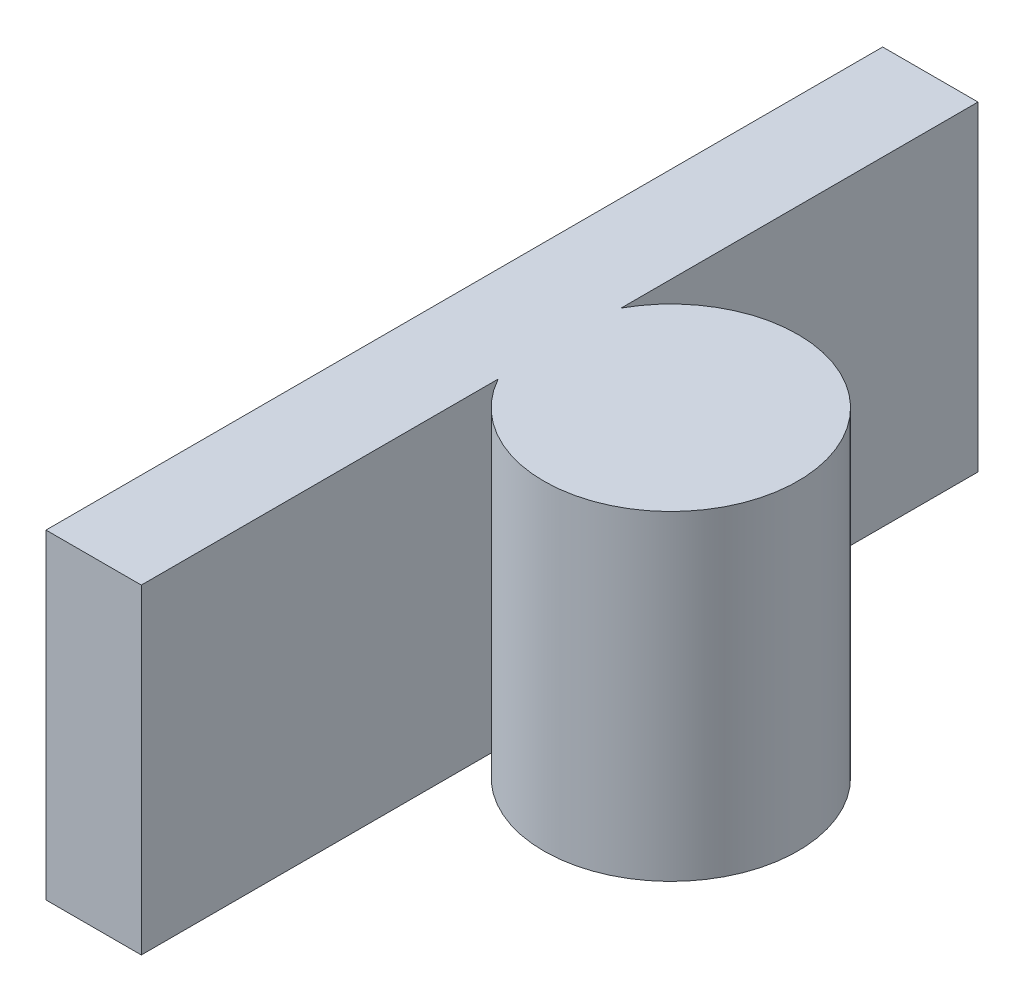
ISO-10303-21;
HEADER;
FILE_DESCRIPTION(('STEP AP214'),'2;1');
FILE_NAME('part.step','',(''),(''),'','','');
FILE_SCHEMA(('AUTOMOTIVE_DESIGN { 1 0 10303 214 1 1 1 1 }'));
ENDSEC;
DATA;
#1=APPLICATION_CONTEXT('core data for automotive mechanical design processes');
#2=APPLICATION_PROTOCOL_DEFINITION('international standard','automotive_design',2000,#1);
#3=PRODUCT_CONTEXT('',#1,'mechanical');
#4=PRODUCT('Part','Part','',(#3));
#5=PRODUCT_RELATED_PRODUCT_CATEGORY('part','',(#4));
#6=PRODUCT_DEFINITION_FORMATION('','',#4);
#7=PRODUCT_DEFINITION_CONTEXT('part definition',#1,'design');
#8=PRODUCT_DEFINITION('design','',#6,#7);
#9=PRODUCT_DEFINITION_SHAPE('','',#8);
#10=(LENGTH_UNIT() NAMED_UNIT(*) SI_UNIT(.MILLI.,.METRE.));
#11=(NAMED_UNIT(*) PLANE_ANGLE_UNIT() SI_UNIT($,.RADIAN.));
#12=(NAMED_UNIT(*) SI_UNIT($,.STERADIAN.) SOLID_ANGLE_UNIT());
#13=UNCERTAINTY_MEASURE_WITH_UNIT(LENGTH_MEASURE(1.E-05),#10,'distance_accuracy_value','');
#14=(GEOMETRIC_REPRESENTATION_CONTEXT(3) GLOBAL_UNCERTAINTY_ASSIGNED_CONTEXT((#13)) GLOBAL_UNIT_ASSIGNED_CONTEXT((#10,
#11,#12)) REPRESENTATION_CONTEXT('',''));
#15=CARTESIAN_POINT('',(0.,0.,0.));
#16=DIRECTION('',(0.,0.,1.));
#17=DIRECTION('',(1.,0.,0.));
#18=AXIS2_PLACEMENT_3D('',#15,#16,#17);
#19=CARTESIAN_POINT('',(31.4445403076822,12.1,3.7756159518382));
#20=DIRECTION('',(0.,-1.,0.));
#21=DIRECTION('',(0.,0.,-1.));
#22=AXIS2_PLACEMENT_3D('',#19,#20,#21);
#23=CYLINDRICAL_SURFACE('',#22,4.79999999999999);
#24=CARTESIAN_POINT('',(31.4445403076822,0.,3.7756159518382));
#25=DIRECTION('',(0.,1.,0.));
#26=DIRECTION('',(0.,0.,1.));
#27=AXIS2_PLACEMENT_3D('',#24,#25,#26);
#28=CIRCLE('',#27,4.79999999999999);
#29=CARTESIAN_POINT('',(27.2445403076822,0.,6.09940595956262));
#30=VERTEX_POINT('',#29);
#31=CARTESIAN_POINT('',(27.2445403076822,0.,1.45182594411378));
#32=VERTEX_POINT('',#31);
#33=EDGE_CURVE('E117',#30,#32,#28,.T.);
#34=ORIENTED_EDGE('',*,*,#33,.T.);
#35=DIRECTION('',(0.,-1.,0.));
#36=VECTOR('',#35,1.);
#37=CARTESIAN_POINT('',(27.2445403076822,12.1,1.45182594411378));
#38=LINE('',#37,#36);
#39=CARTESIAN_POINT('',(27.2445403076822,12.1,1.45182594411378));
#40=VERTEX_POINT('',#39);
#41=EDGE_CURVE('E11',#40,#32,#38,.T.);
#42=ORIENTED_EDGE('',*,*,#41,.F.);
#43=CARTESIAN_POINT('',(31.4445403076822,12.1,3.7756159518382));
#44=DIRECTION('',(0.,1.,0.));
#45=DIRECTION('',(0.,0.,1.));
#46=AXIS2_PLACEMENT_3D('',#43,#44,#45);
#47=CIRCLE('',#46,4.79999999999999);
#48=CARTESIAN_POINT('',(27.2445403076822,12.1,6.09940595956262));
#49=VERTEX_POINT('',#48);
#50=EDGE_CURVE('E127',#49,#40,#47,.T.);
#51=ORIENTED_EDGE('',*,*,#50,.F.);
#52=DIRECTION('',(0.,-1.,0.));
#53=VECTOR('',#52,1.);
#54=CARTESIAN_POINT('',(27.2445403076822,12.1,6.09940595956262));
#55=LINE('',#54,#53);
#56=EDGE_CURVE('E113',#49,#30,#55,.T.);
#57=ORIENTED_EDGE('',*,*,#56,.T.);
#58=EDGE_LOOP('',(#34,#42,#51,#57));
#59=FACE_BOUND('',#58,.T.);
#60=ADVANCED_FACE('F33',(#59),#23,.T.);
#61=CARTESIAN_POINT('',(27.2445403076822,12.1,-12.0243840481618));
#62=DIRECTION('',(-1.,0.,0.));
#63=DIRECTION('',(0.,0.,1.));
#64=AXIS2_PLACEMENT_3D('',#61,#62,#63);
#65=PLANE('',#64);
#66=DIRECTION('',(0.,0.,-1.));
#67=VECTOR('',#66,1.);
#68=CARTESIAN_POINT('',(27.2445403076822,0.,-12.0243840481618));
#69=LINE('',#68,#67);
#70=CARTESIAN_POINT('',(27.2445403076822,0.,-12.0243840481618));
#71=VERTEX_POINT('',#70);
#72=EDGE_CURVE('E120',#32,#71,#69,.T.);
#73=ORIENTED_EDGE('',*,*,#72,.T.);
#74=DIRECTION('',(0.,-1.,0.));
#75=VECTOR('',#74,1.);
#76=CARTESIAN_POINT('',(27.2445403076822,12.1,-12.0243840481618));
#77=LINE('',#76,#75);
#78=CARTESIAN_POINT('',(27.2445403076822,12.1,-12.0243840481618));
#79=VERTEX_POINT('',#78);
#80=EDGE_CURVE('E41',#79,#71,#77,.T.);
#81=ORIENTED_EDGE('',*,*,#80,.F.);
#82=DIRECTION('',(0.,0.,-1.));
#83=VECTOR('',#82,1.);
#84=CARTESIAN_POINT('',(27.2445403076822,12.1,-12.0243840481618));
#85=LINE('',#84,#83);
#86=EDGE_CURVE('E86',#40,#79,#85,.T.);
#87=ORIENTED_EDGE('',*,*,#86,.F.);
#88=ORIENTED_EDGE('',*,*,#41,.T.);
#89=EDGE_LOOP('',(#73,#81,#87,#88));
#90=FACE_BOUND('',#89,.T.);
#91=ADVANCED_FACE('F151',(#90),#65,.F.);
#92=CARTESIAN_POINT('',(27.2445403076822,12.1,-12.0243840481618));
#93=DIRECTION('',(0.,0.,1.));
#94=DIRECTION('',(1.,0.,0.));
#95=AXIS2_PLACEMENT_3D('',#92,#93,#94);
#96=PLANE('',#95);
#97=DIRECTION('',(-1.,0.,0.));
#98=VECTOR('',#97,1.);
#99=CARTESIAN_POINT('',(27.2445403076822,0.,-12.0243840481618));
#100=LINE('',#99,#98);
#101=CARTESIAN_POINT('',(23.6445403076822,0.,-12.0243840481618));
#102=VERTEX_POINT('',#101);
#103=EDGE_CURVE('E122',#71,#102,#100,.T.);
#104=ORIENTED_EDGE('',*,*,#103,.T.);
#105=DIRECTION('',(0.,-1.,0.));
#106=VECTOR('',#105,1.);
#107=CARTESIAN_POINT('',(23.6445403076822,12.1,-12.0243840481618));
#108=LINE('',#107,#106);
#109=CARTESIAN_POINT('',(23.6445403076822,12.1,-12.0243840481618));
#110=VERTEX_POINT('',#109);
#111=EDGE_CURVE('E108',#110,#102,#108,.T.);
#112=ORIENTED_EDGE('',*,*,#111,.F.);
#113=DIRECTION('',(-1.,0.,0.));
#114=VECTOR('',#113,1.);
#115=CARTESIAN_POINT('',(27.2445403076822,12.1,-12.0243840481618));
#116=LINE('',#115,#114);
#117=EDGE_CURVE('E99',#79,#110,#116,.T.);
#118=ORIENTED_EDGE('',*,*,#117,.F.);
#119=ORIENTED_EDGE('',*,*,#80,.T.);
#120=EDGE_LOOP('',(#104,#112,#118,#119));
#121=FACE_BOUND('',#120,.T.);
#122=ADVANCED_FACE('F133',(#121),#96,.F.);
#123=CARTESIAN_POINT('',(23.6445403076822,12.1,-12.0243840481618));
#124=DIRECTION('',(1.,0.,0.));
#125=DIRECTION('',(0.,0.,-1.));
#126=AXIS2_PLACEMENT_3D('',#123,#124,#125);
#127=PLANE('',#126);
#128=DIRECTION('',(0.,0.,1.));
#129=VECTOR('',#128,1.);
#130=CARTESIAN_POINT('',(23.6445403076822,0.,-12.0243840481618));
#131=LINE('',#130,#129);
#132=CARTESIAN_POINT('',(23.6445403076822,0.,19.5756159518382));
#133=VERTEX_POINT('',#132);
#134=EDGE_CURVE('E107',#102,#133,#131,.T.);
#135=ORIENTED_EDGE('',*,*,#134,.T.);
#136=DIRECTION('',(0.,-1.,0.));
#137=VECTOR('',#136,1.);
#138=CARTESIAN_POINT('',(23.6445403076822,12.1,19.5756159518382));
#139=LINE('',#138,#137);
#140=CARTESIAN_POINT('',(23.6445403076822,12.1,19.5756159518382));
#141=VERTEX_POINT('',#140);
#142=EDGE_CURVE('E104',#141,#133,#139,.T.);
#143=ORIENTED_EDGE('',*,*,#142,.F.);
#144=DIRECTION('',(0.,0.,1.));
#145=VECTOR('',#144,1.);
#146=CARTESIAN_POINT('',(23.6445403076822,12.1,-12.0243840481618));
#147=LINE('',#146,#145);
#148=EDGE_CURVE('E93',#110,#141,#147,.T.);
#149=ORIENTED_EDGE('',*,*,#148,.F.);
#150=ORIENTED_EDGE('',*,*,#111,.T.);
#151=EDGE_LOOP('',(#135,#143,#149,#150));
#152=FACE_BOUND('',#151,.T.);
#153=ADVANCED_FACE('F105',(#152),#127,.F.);
#154=CARTESIAN_POINT('',(27.2445403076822,12.1,19.5756159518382));
#155=DIRECTION('',(0.,0.,-1.));
#156=DIRECTION('',(-1.,0.,0.));
#157=AXIS2_PLACEMENT_3D('',#154,#155,#156);
#158=PLANE('',#157);
#159=DIRECTION('',(1.,0.,0.));
#160=VECTOR('',#159,1.);
#161=CARTESIAN_POINT('',(27.2445403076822,0.,19.5756159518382));
#162=LINE('',#161,#160);
#163=CARTESIAN_POINT('',(27.2445403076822,0.,19.5756159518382));
#164=VERTEX_POINT('',#163);
#165=EDGE_CURVE('E72',#133,#164,#162,.T.);
#166=ORIENTED_EDGE('',*,*,#165,.T.);
#167=DIRECTION('',(0.,-1.,0.));
#168=VECTOR('',#167,1.);
#169=CARTESIAN_POINT('',(27.2445403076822,12.1,19.5756159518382));
#170=LINE('',#169,#168);
#171=CARTESIAN_POINT('',(27.2445403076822,12.1,19.5756159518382));
#172=VERTEX_POINT('',#171);
#173=EDGE_CURVE('E109',#172,#164,#170,.T.);
#174=ORIENTED_EDGE('',*,*,#173,.F.);
#175=DIRECTION('',(1.,0.,0.));
#176=VECTOR('',#175,1.);
#177=CARTESIAN_POINT('',(27.2445403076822,12.1,19.5756159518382));
#178=LINE('',#177,#176);
#179=EDGE_CURVE('E97',#141,#172,#178,.T.);
#180=ORIENTED_EDGE('',*,*,#179,.F.);
#181=ORIENTED_EDGE('',*,*,#142,.T.);
#182=EDGE_LOOP('',(#166,#174,#180,#181));
#183=FACE_BOUND('',#182,.T.);
#184=ADVANCED_FACE('F111',(#183),#158,.F.);
#185=CARTESIAN_POINT('',(27.2445403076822,12.1,6.09940595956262));
#186=DIRECTION('',(-1.,0.,0.));
#187=DIRECTION('',(0.,0.,1.));
#188=AXIS2_PLACEMENT_3D('',#185,#186,#187);
#189=PLANE('',#188);
#190=DIRECTION('',(0.,0.,-1.));
#191=VECTOR('',#190,1.);
#192=CARTESIAN_POINT('',(27.2445403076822,0.,6.09940595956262));
#193=LINE('',#192,#191);
#194=EDGE_CURVE('E78',#164,#30,#193,.T.);
#195=ORIENTED_EDGE('',*,*,#194,.T.);
#196=ORIENTED_EDGE('',*,*,#56,.F.);
#197=DIRECTION('',(0.,0.,-1.));
#198=VECTOR('',#197,1.);
#199=CARTESIAN_POINT('',(27.2445403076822,12.1,6.09940595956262));
#200=LINE('',#199,#198);
#201=EDGE_CURVE('E49',#172,#49,#200,.T.);
#202=ORIENTED_EDGE('',*,*,#201,.F.);
#203=ORIENTED_EDGE('',*,*,#173,.T.);
#204=EDGE_LOOP('',(#195,#196,#202,#203));
#205=FACE_BOUND('',#204,.T.);
#206=ADVANCED_FACE('F140',(#205),#189,.F.);
#207=CARTESIAN_POINT('',(31.4445403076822,12.1,3.7756159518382));
#208=DIRECTION('',(0.,1.,0.));
#209=DIRECTION('',(0.,0.,1.));
#210=AXIS2_PLACEMENT_3D('',#207,#208,#209);
#211=PLANE('',#210);
#212=ORIENTED_EDGE('',*,*,#50,.T.);
#213=ORIENTED_EDGE('',*,*,#86,.T.);
#214=ORIENTED_EDGE('',*,*,#117,.T.);
#215=ORIENTED_EDGE('',*,*,#148,.T.);
#216=ORIENTED_EDGE('',*,*,#179,.T.);
#217=ORIENTED_EDGE('',*,*,#201,.T.);
#218=EDGE_LOOP('',(#212,#213,#214,#215,#216,#217));
#219=FACE_BOUND('',#218,.T.);
#220=ADVANCED_FACE('F95',(#219),#211,.T.);
#221=CARTESIAN_POINT('',(31.4445403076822,0.,3.7756159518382));
#222=DIRECTION('',(0.,1.,0.));
#223=DIRECTION('',(0.,0.,1.));
#224=AXIS2_PLACEMENT_3D('',#221,#222,#223);
#225=PLANE('',#224);
#226=ORIENTED_EDGE('',*,*,#33,.F.);
#227=ORIENTED_EDGE('',*,*,#194,.F.);
#228=ORIENTED_EDGE('',*,*,#165,.F.);
#229=ORIENTED_EDGE('',*,*,#134,.F.);
#230=ORIENTED_EDGE('',*,*,#103,.F.);
#231=ORIENTED_EDGE('',*,*,#72,.F.);
#232=EDGE_LOOP('',(#226,#227,#228,#229,#230,#231));
#233=FACE_BOUND('',#232,.T.);
#234=ADVANCED_FACE('F136',(#233),#225,.F.);
#235=CLOSED_SHELL('',(#60,#91,#122,#153,#184,#206,#220,#234));
#236=MANIFOLD_SOLID_BREP('B2',#235);
#237=ADVANCED_BREP_SHAPE_REPRESENTATION('',(#18,#236),#14);
#238=SHAPE_DEFINITION_REPRESENTATION(#9,#237);
ENDSEC;
END-ISO-10303-21;
